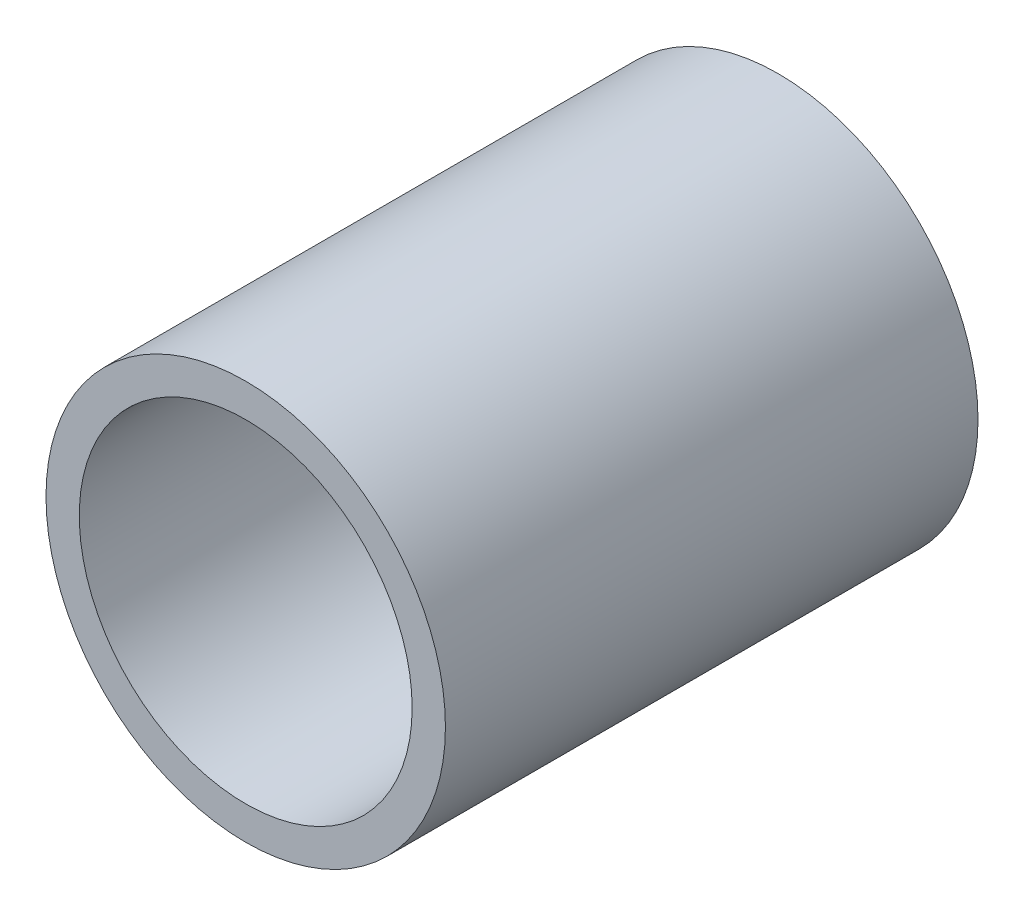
from build123d import *

# Parameters (mm, degrees)
SKETCH1_R      = 19.05
SKETCH1_R_2    = 15.875
EXTRUDE1_DEPTH = 50.8


with BuildPart() as part:
    # Sketch1 → Extrude1 (new body)
    with BuildSketch(Plane.XY):
        Circle(SKETCH1_R)
        Circle(SKETCH1_R_2, mode=Mode.SUBTRACT)
    extrude(amount=EXTRUDE1_DEPTH)


solid = part.part
